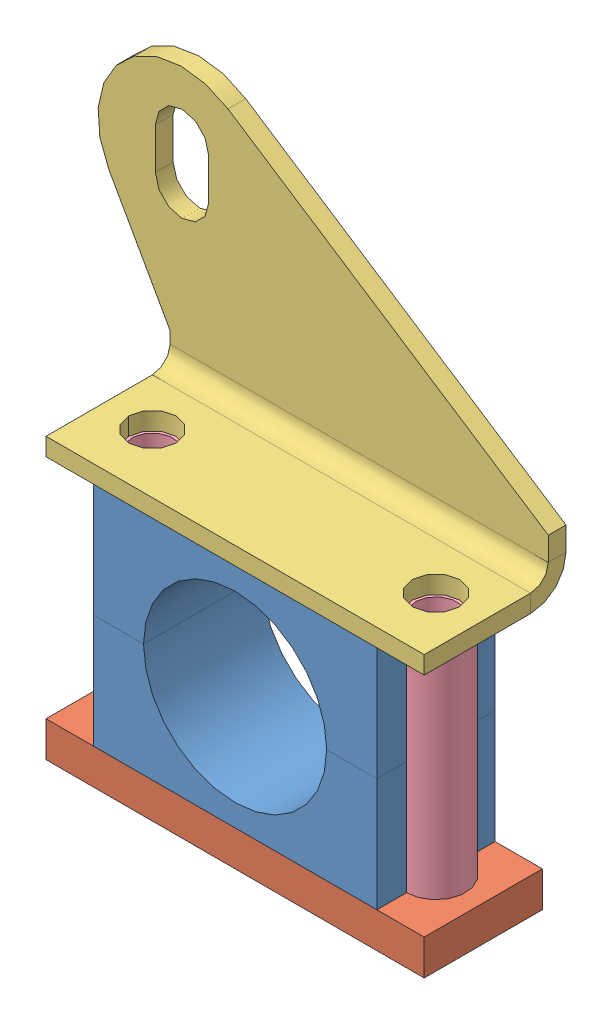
SolidWorks assembly shaft clamp.SLDASM, configuration RIGHT HAND (file format 3693). Lengths in mm.
Overall size (121 146.19 38.1).
6 component instances, 4 part files, 14 mates.
Components (placement in the parent):
- 101511005-1: 101511005.sldprt [Simple] at origin size (76.2 30.48 31.75)
- 101511005-2: 101511005.sldprt [Simple] at (76.2 60.96 0) x (-1 0 0) z (0 0 1) size (76.2 30.48 31.75)
- 124607001-1: 124607001.sldprt [Simple] at (-12.7 -4.7625 0) x (1 0 0) z (0 1 0) size (101.6 31.75 9.53)
- 404546001-1: 404546001.sldprt [Simple] at (88.9 60.96 -38.1) x (0 0 -1) z (1 0 0) size (38.1 75.7 121)
- 101510005-1: 101510005.sldprt [Simple] at (76.2 60.96 -15.875) x (0.887036 0 0.4617) z (0 1 0) size (15.88 15.88 70.48)
- 101510005-2: 101510005.sldprt [Simple] at (0 60.96 -15.875) x (0.861605 0 0.507579) z (0 1 0) size (15.88 15.88 70.48)
Mates (geometry in assembly coordinates):
- Concentric1: concentric aligned: cylinder of 101511005-1; cylinder of 101511005-2
- Coincident1: coincident aligned: plane of 101511005-1 through (0 60.96 0) normal (0 0 1); plane of 101511005-2 through (76.2 0 0) normal (0 0 1)
- Coincident2: coincident anti-aligned: plane of 101511005-1 through (0 0 -31.75) normal (0 -1 0); plane of 124607001-1 through (-12.7 0 -31.75) normal (0 1 0)
- Concentric2: concentric aligned: cylinder of 101511005-1; cylinder of 124607001-1
- Parallel1: parallel aligned: plane of 101511005-1 through (0 60.96 0) normal (0 0 1); plane of 124607001-1 through (-12.7 -9.525 0) normal (0 0 1)
- Concentric3: concentric anti-aligned: cylinder of 101510005-1; cylinder of 101511005-2
- Concentric4: concentric aligned: cylinder of 124607001-1; cylinder of 101510005-1
- Coincident4: coincident anti-aligned: plane of 124607001-1 through (-12.7 0 -31.75) normal (0 1 0); plane of 101510005-1 through (76.2 0 -15.875) normal (0 -1 0)
- Concentric5: concentric aligned: cylinder of 124607001-1; cylinder of 101510005-2
- Coincident5: coincident anti-aligned: plane of 124607001-1 through (-12.7 0 -31.75) normal (0 1 0); plane of 101510005-2 through (0 0 -15.875) normal (0 -1 0)
- Parallel3: parallel aligned: plane of 101511005-1 through (-7.0773 30.48 138.1954) normal (0 1 0); plane of 101511005-2 through (76.2 60.96 -31.75) normal (0 1 0)
- Coincident17: coincident anti-aligned: plane of 101511005-2 through (76.2 60.96 -31.75) normal (0 1 0); plane of 404546001-1 through (-12.7 60.96 -38.1) normal (0 -1 0)
- Concentric11: concentric aligned: cylinder of 404546001-1; cylinder of 101510005-2
- Parallel5: parallel aligned: plane of 101511005-2 through (76.2 0 0) normal (0 0 1); plane of 404546001-1 through (-12.7 276.8063 0) normal (0 0 1)
